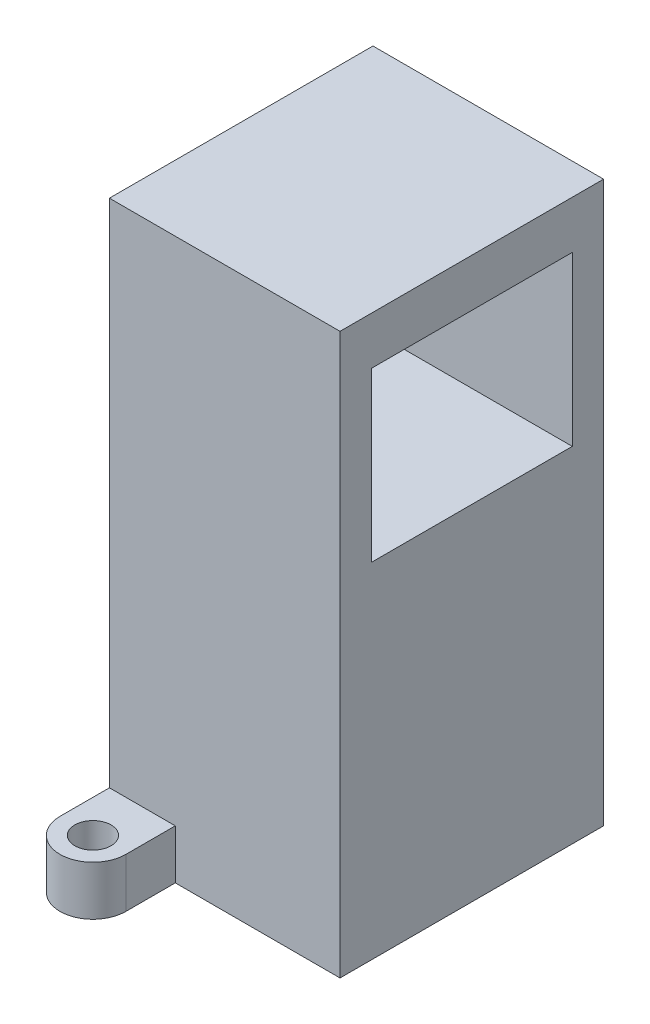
from build123d import *

# Parameters (mm, degrees)
SKETCH_1_W               = 14
SKETCH_1_H               = 16
EXTRUDE_1_DEPTH          = 34
CUT_EXTRUDE_1_DEPTH      = 36.623026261
CUT_EXTRUDE_1_DEPTH_BACK = 36.623026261
SKETCH_2_W               = 12.2
SKETCH_2_H               = 10.2
SKETCH_3_R               = 1.1
EXTRUDE_2_DEPTH          = 3


with BuildPart() as part:
    # Sketch 1 → Extrude 1 (new body)
    with BuildSketch(Plane(origin=(0, 0, 0), x_dir=(1, 0, 0), z_dir=(0, 1, 0))):
        Rectangle(SKETCH_1_W, SKETCH_1_H)
    extrude(amount=EXTRUDE_1_DEPTH)

    # Sketch 2 → Cut-Extrude 1 (cut, two sides: drawn at the far end of the back side and taken through both)
    with BuildSketch(Plane(origin=(0, 0, 0), x_dir=(0, 0, -1), z_dir=(1, 0, 0)).offset(-CUT_EXTRUDE_1_DEPTH_BACK)):
        with Locations((0, 26)):
            Rectangle(SKETCH_2_W, SKETCH_2_H)
    extrude(amount=CUT_EXTRUDE_1_DEPTH + CUT_EXTRUDE_1_DEPTH_BACK, mode=Mode.SUBTRACT)

    # Sketch 3 → Extrude 2 (add)
    with BuildSketch(Plane(origin=(0, 0, 0), x_dir=(1, 0, 0), z_dir=(0, 1, 0))):
        with BuildLine():
            Line((-7, 8), (-7, 11))
            ThreePointArc((-7, 11), (-5, 13), (-3, 11))
            Line((-3, 11), (-3, 8))
            Line((-3, 8), (-7, 8))
        make_face()
        with Locations(Location((-5, 11, 0), (0, 0, 270))):
            Circle(SKETCH_3_R, mode=Mode.SUBTRACT)
    extrude_2 = extrude(amount=EXTRUDE_2_DEPTH)

    # Mirror 1: Extrude 2 across plane
    add(extrude_2.mirror(Plane.XY))


solid = part.part
